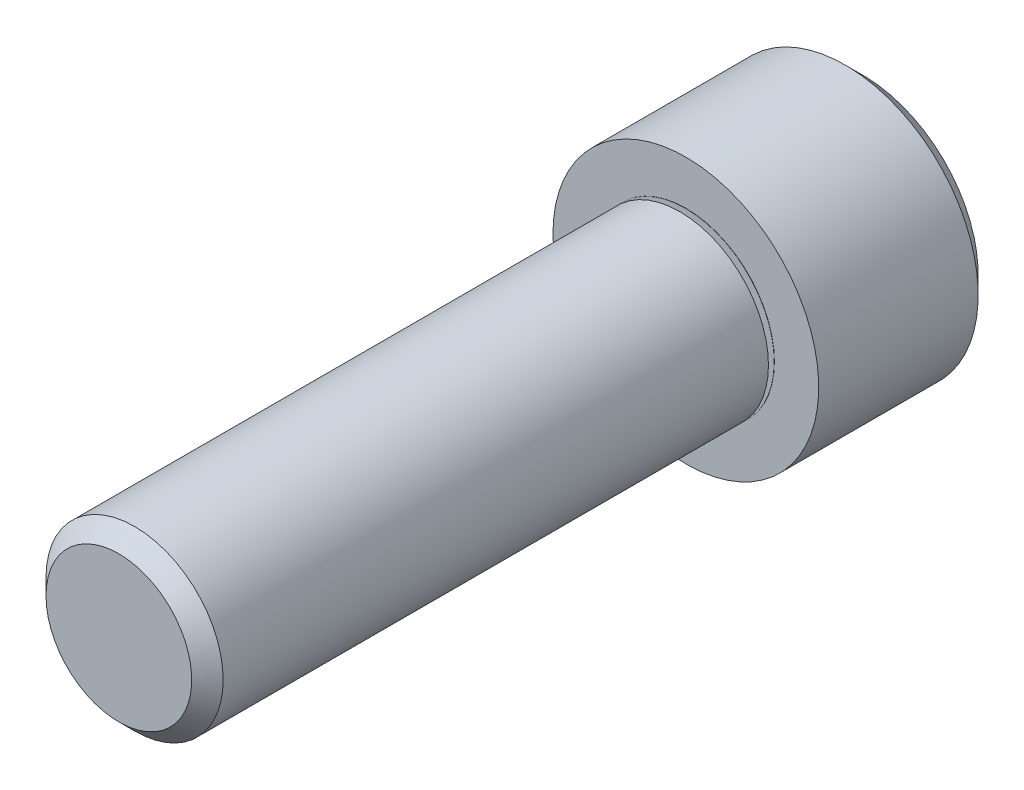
ISO-10303-21;
HEADER;
FILE_DESCRIPTION(('STEP AP214'),'2;1');
FILE_NAME('part.step','',(''),(''),'','','');
FILE_SCHEMA(('AUTOMOTIVE_DESIGN { 1 0 10303 214 1 1 1 1 }'));
ENDSEC;
DATA;
#1=APPLICATION_CONTEXT('core data for automotive mechanical design processes');
#2=APPLICATION_PROTOCOL_DEFINITION('international standard','automotive_design',2000,#1);
#3=PRODUCT_CONTEXT('',#1,'mechanical');
#4=PRODUCT('Part','Part','',(#3));
#5=PRODUCT_RELATED_PRODUCT_CATEGORY('part','',(#4));
#6=PRODUCT_DEFINITION_FORMATION('','',#4);
#7=PRODUCT_DEFINITION_CONTEXT('part definition',#1,'design');
#8=PRODUCT_DEFINITION('design','',#6,#7);
#9=PRODUCT_DEFINITION_SHAPE('','',#8);
#10=(LENGTH_UNIT() NAMED_UNIT(*) SI_UNIT(.MILLI.,.METRE.));
#11=(NAMED_UNIT(*) PLANE_ANGLE_UNIT() SI_UNIT($,.RADIAN.));
#12=(NAMED_UNIT(*) SI_UNIT($,.STERADIAN.) SOLID_ANGLE_UNIT());
#13=UNCERTAINTY_MEASURE_WITH_UNIT(LENGTH_MEASURE(1.E-05),#10,'distance_accuracy_value','');
#14=(GEOMETRIC_REPRESENTATION_CONTEXT(3) GLOBAL_UNCERTAINTY_ASSIGNED_CONTEXT((#13)) GLOBAL_UNIT_ASSIGNED_CONTEXT((#10,
#11,#12)) REPRESENTATION_CONTEXT('',''));
#15=CARTESIAN_POINT('',(0.,0.,0.));
#16=DIRECTION('',(0.,0.,1.));
#17=DIRECTION('',(1.,0.,0.));
#18=AXIS2_PLACEMENT_3D('',#15,#16,#17);
#19=CARTESIAN_POINT('',(0.,0.,-7.93749999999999));
#20=DIRECTION('',(0.,0.,1.));
#21=DIRECTION('',(1.,0.,0.));
#22=AXIS2_PLACEMENT_3D('',#19,#20,#21);
#23=PLANE('',#22);
#24=DIRECTION('',(-0.5,-0.866025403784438,0.));
#25=VECTOR('',#24,1.);
#26=CARTESIAN_POINT('',(3.66617420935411,0.,-7.93749999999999));
#27=LINE('',#26,#25);
#28=CARTESIAN_POINT('',(3.66617420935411,0.,-7.93749999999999));
#29=VERTEX_POINT('',#28);
#30=CARTESIAN_POINT('',(1.83308710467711,-3.17500000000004,-7.93749999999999));
#31=VERTEX_POINT('',#30);
#32=EDGE_CURVE('E164',#29,#31,#27,.T.);
#33=ORIENTED_EDGE('',*,*,#32,.F.);
#34=DIRECTION('',(0.499999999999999,-0.866025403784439,0.));
#35=VECTOR('',#34,1.);
#36=CARTESIAN_POINT('',(1.83308710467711,3.17499999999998,-7.93749999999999));
#37=LINE('',#36,#35);
#38=CARTESIAN_POINT('',(1.83308710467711,3.17499999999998,-7.93749999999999));
#39=VERTEX_POINT('',#38);
#40=EDGE_CURVE('E73',#39,#29,#37,.T.);
#41=ORIENTED_EDGE('',*,*,#40,.F.);
#42=DIRECTION('',(1.,0.,0.));
#43=VECTOR('',#42,1.);
#44=CARTESIAN_POINT('',(-1.83308710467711,3.17499999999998,-7.93749999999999));
#45=LINE('',#44,#43);
#46=CARTESIAN_POINT('',(-1.83308710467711,3.17499999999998,-7.93749999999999));
#47=VERTEX_POINT('',#46);
#48=EDGE_CURVE('E177',#47,#39,#45,.T.);
#49=ORIENTED_EDGE('',*,*,#48,.F.);
#50=DIRECTION('',(0.5,0.866025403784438,0.));
#51=VECTOR('',#50,1.);
#52=CARTESIAN_POINT('',(-3.66617420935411,0.,-7.93749999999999));
#53=LINE('',#52,#51);
#54=CARTESIAN_POINT('',(-3.66617420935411,0.,-7.93749999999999));
#55=VERTEX_POINT('',#54);
#56=EDGE_CURVE('E174',#55,#47,#53,.T.);
#57=ORIENTED_EDGE('',*,*,#56,.F.);
#58=DIRECTION('',(-0.5,0.866025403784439,0.));
#59=VECTOR('',#58,1.);
#60=CARTESIAN_POINT('',(-1.83308710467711,-3.17500000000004,-7.93749999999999));
#61=LINE('',#60,#59);
#62=CARTESIAN_POINT('',(-1.83308710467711,-3.17500000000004,-7.93749999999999));
#63=VERTEX_POINT('',#62);
#64=EDGE_CURVE('E130',#63,#55,#61,.T.);
#65=ORIENTED_EDGE('',*,*,#64,.F.);
#66=DIRECTION('',(-1.,0.,0.));
#67=VECTOR('',#66,1.);
#68=CARTESIAN_POINT('',(1.83308710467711,-3.17500000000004,-7.93749999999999));
#69=LINE('',#68,#67);
#70=EDGE_CURVE('E168',#31,#63,#69,.T.);
#71=ORIENTED_EDGE('',*,*,#70,.F.);
#72=EDGE_LOOP('',(#33,#41,#49,#57,#65,#71));
#73=FACE_BOUND('',#72,.T.);
#74=CARTESIAN_POINT('',(0.,0.,-7.93749999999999));
#75=DIRECTION('',(0.,0.,-1.));
#76=DIRECTION('',(-1.,0.,0.));
#77=AXIS2_PLACEMENT_3D('',#74,#75,#76);
#78=CIRCLE('',#77,5.15937500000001);
#79=CARTESIAN_POINT('',(-5.15937500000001,0.,-7.93749999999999));
#80=VERTEX_POINT('',#79);
#81=EDGE_CURVE('E183',#80,#80,#78,.T.);
#82=ORIENTED_EDGE('',*,*,#81,.T.);
#83=EDGE_LOOP('',(#82));
#84=FACE_BOUND('',#83,.T.);
#85=ADVANCED_FACE('F55',(#73,#84),#23,.F.);
#86=CARTESIAN_POINT('',(-3.26389999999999,0.,25.4));
#87=DIRECTION('',(0.,0.,-1.));
#88=DIRECTION('',(-1.,0.,0.));
#89=AXIS2_PLACEMENT_3D('',#86,#87,#88);
#90=PLANE('',#89);
#91=CARTESIAN_POINT('',(0.,0.,25.4));
#92=DIRECTION('',(0.,0.,-1.));
#93=DIRECTION('',(-1.,0.,0.));
#94=AXIS2_PLACEMENT_3D('',#91,#92,#93);
#95=CIRCLE('',#94,3.26390000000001);
#96=CARTESIAN_POINT('',(-3.26390000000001,0.,25.4));
#97=VERTEX_POINT('',#96);
#98=EDGE_CURVE('E11',#97,#97,#95,.T.);
#99=ORIENTED_EDGE('',*,*,#98,.F.);
#100=EDGE_LOOP('',(#99));
#101=FACE_BOUND('',#100,.T.);
#102=ADVANCED_FACE('F234',(#101),#90,.F.);
#103=CARTESIAN_POINT('',(0.,0.,25.4));
#104=DIRECTION('',(0.,0.,-1.));
#105=DIRECTION('',(-1.,0.,0.));
#106=AXIS2_PLACEMENT_3D('',#103,#104,#105);
#107=CONICAL_SURFACE('',#106,3.26390000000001,0.785398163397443);
#108=CARTESIAN_POINT('',(0.,0.,24.69515));
#109=DIRECTION('',(0.,0.,-1.));
#110=DIRECTION('',(-1.,0.,0.));
#111=AXIS2_PLACEMENT_3D('',#108,#109,#110);
#112=CIRCLE('',#111,3.96875000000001);
#113=CARTESIAN_POINT('',(-3.96875000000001,0.,24.69515));
#114=VERTEX_POINT('',#113);
#115=EDGE_CURVE('E63',#114,#114,#112,.T.);
#116=ORIENTED_EDGE('',*,*,#115,.F.);
#117=EDGE_LOOP('',(#116));
#118=FACE_BOUND('',#117,.T.);
#119=ORIENTED_EDGE('',*,*,#98,.T.);
#120=EDGE_LOOP('',(#119));
#121=FACE_BOUND('',#120,.T.);
#122=ADVANCED_FACE('F231',(#118,#121),#107,.T.);
#123=CARTESIAN_POINT('',(0.,0.,-10.585154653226));
#124=DIRECTION('',(0.,0.,-1.));
#125=DIRECTION('',(-1.,0.,0.));
#126=AXIS2_PLACEMENT_3D('',#123,#124,#125);
#127=CYLINDRICAL_SURFACE('',#126,3.96875000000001);
#128=CARTESIAN_POINT('',(0.,0.,0.266544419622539));
#129=DIRECTION('',(0.,0.,-1.));
#130=DIRECTION('',(-1.,0.,0.));
#131=AXIS2_PLACEMENT_3D('',#128,#129,#130);
#132=CIRCLE('',#131,3.96875000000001);
#133=CARTESIAN_POINT('',(-3.96875000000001,0.,0.266544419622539));
#134=VERTEX_POINT('',#133);
#135=EDGE_CURVE('E220',#134,#134,#132,.T.);
#136=ORIENTED_EDGE('',*,*,#135,.F.);
#137=EDGE_LOOP('',(#136));
#138=FACE_BOUND('',#137,.T.);
#139=ORIENTED_EDGE('',*,*,#115,.T.);
#140=EDGE_LOOP('',(#139));
#141=FACE_BOUND('',#140,.T.);
#142=ADVANCED_FACE('F229',(#138,#141),#127,.T.);
#143=CARTESIAN_POINT('',(0.,0.,0.266544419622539));
#144=DIRECTION('',(0.,0.,1.));
#145=DIRECTION('',(1.,0.,0.));
#146=AXIS2_PLACEMENT_3D('',#143,#144,#145);
#147=CONICAL_SURFACE('',#146,3.96875000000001,1.22173047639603);
#148=CARTESIAN_POINT('',(0.,0.,0.0487938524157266));
#149=DIRECTION('',(0.,0.,-1.));
#150=DIRECTION('',(-1.,0.,0.));
#151=AXIS2_PLACEMENT_3D('',#148,#149,#150);
#152=CIRCLE('',#151,3.37048523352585);
#153=CARTESIAN_POINT('',(-3.37048523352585,0.,0.0487938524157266));
#154=VERTEX_POINT('',#153);
#155=EDGE_CURVE('E216',#154,#154,#152,.T.);
#156=ORIENTED_EDGE('',*,*,#155,.F.);
#157=EDGE_LOOP('',(#156));
#158=FACE_BOUND('',#157,.T.);
#159=ORIENTED_EDGE('',*,*,#135,.T.);
#160=EDGE_LOOP('',(#159));
#161=FACE_BOUND('',#160,.T.);
#162=ADVANCED_FACE('F248',(#158,#161),#147,.T.);
#163=CARTESIAN_POINT('',(0.,0.,0.0300000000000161));
#164=DIRECTION('',(0.,0.,-1.));
#165=DIRECTION('',(-1.,0.,0.));
#166=AXIS2_PLACEMENT_3D('',#163,#164,#165);
#167=TOROIDAL_SURFACE('',#166,3.37732563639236,0.0199999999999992);
#168=CARTESIAN_POINT('',(0.,0.,0.0100000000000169));
#169=DIRECTION('',(0.,0.,-1.));
#170=DIRECTION('',(-1.,0.,0.));
#171=AXIS2_PLACEMENT_3D('',#168,#169,#170);
#172=CIRCLE('',#171,3.37732563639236);
#173=CARTESIAN_POINT('',(-3.37732563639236,0.,0.0100000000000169));
#174=VERTEX_POINT('',#173);
#175=EDGE_CURVE('E212',#174,#174,#172,.T.);
#176=ORIENTED_EDGE('',*,*,#175,.F.);
#177=EDGE_LOOP('',(#176));
#178=FACE_BOUND('',#177,.T.);
#179=ORIENTED_EDGE('',*,*,#155,.T.);
#180=EDGE_LOOP('',(#179));
#181=FACE_BOUND('',#180,.T.);
#182=ADVANCED_FACE('F252',(#178,#181),#167,.F.);
#183=CARTESIAN_POINT('',(-3.96874999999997,0.,0.01000000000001));
#184=DIRECTION('',(0.,0.,-1.));
#185=DIRECTION('',(-1.,0.,0.));
#186=AXIS2_PLACEMENT_3D('',#183,#184,#185);
#187=PLANE('',#186);
#188=CARTESIAN_POINT('',(0.,0.,0.01000000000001));
#189=DIRECTION('',(0.,0.,-1.));
#190=DIRECTION('',(-1.,0.,0.));
#191=AXIS2_PLACEMENT_3D('',#188,#189,#190);
#192=CIRCLE('',#191,3.96875);
#193=CARTESIAN_POINT('',(-3.96875,0.,0.01000000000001));
#194=VERTEX_POINT('',#193);
#195=EDGE_CURVE('E208',#194,#194,#192,.T.);
#196=ORIENTED_EDGE('',*,*,#195,.F.);
#197=EDGE_LOOP('',(#196));
#198=FACE_BOUND('',#197,.T.);
#199=ORIENTED_EDGE('',*,*,#175,.T.);
#200=EDGE_LOOP('',(#199));
#201=FACE_BOUND('',#200,.T.);
#202=ADVANCED_FACE('F256',(#198,#201),#187,.F.);
#203=CARTESIAN_POINT('',(0.,0.,-10.585154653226));
#204=DIRECTION('',(0.,0.,-1.));
#205=DIRECTION('',(-1.,0.,0.));
#206=AXIS2_PLACEMENT_3D('',#203,#204,#205);
#207=CYLINDRICAL_SURFACE('',#206,3.96875);
#208=CARTESIAN_POINT('',(0.,0.,0.));
#209=DIRECTION('',(0.,0.,-1.));
#210=DIRECTION('',(-1.,0.,0.));
#211=AXIS2_PLACEMENT_3D('',#208,#209,#210);
#212=CIRCLE('',#211,3.96875);
#213=CARTESIAN_POINT('',(-3.96875,0.,0.));
#214=VERTEX_POINT('',#213);
#215=EDGE_CURVE('E204',#214,#214,#212,.T.);
#216=ORIENTED_EDGE('',*,*,#215,.F.);
#217=EDGE_LOOP('',(#216));
#218=FACE_BOUND('',#217,.T.);
#219=ORIENTED_EDGE('',*,*,#195,.T.);
#220=EDGE_LOOP('',(#219));
#221=FACE_BOUND('',#220,.T.);
#222=ADVANCED_FACE('F260',(#218,#221),#207,.T.);
#223=CARTESIAN_POINT('',(-5.953125,0.,0.));
#224=DIRECTION('',(0.,0.,-1.));
#225=DIRECTION('',(-1.,0.,0.));
#226=AXIS2_PLACEMENT_3D('',#223,#224,#225);
#227=PLANE('',#226);
#228=CARTESIAN_POINT('',(0.,0.,0.));
#229=DIRECTION('',(0.,0.,-1.));
#230=DIRECTION('',(-1.,0.,0.));
#231=AXIS2_PLACEMENT_3D('',#228,#229,#230);
#232=CIRCLE('',#231,5.95312500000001);
#233=CARTESIAN_POINT('',(-5.95312500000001,0.,0.));
#234=VERTEX_POINT('',#233);
#235=EDGE_CURVE('E200',#234,#234,#232,.T.);
#236=ORIENTED_EDGE('',*,*,#235,.F.);
#237=EDGE_LOOP('',(#236));
#238=FACE_BOUND('',#237,.T.);
#239=ORIENTED_EDGE('',*,*,#215,.T.);
#240=EDGE_LOOP('',(#239));
#241=FACE_BOUND('',#240,.T.);
#242=ADVANCED_FACE('F264',(#238,#241),#227,.F.);
#243=CARTESIAN_POINT('',(0.,0.,-10.585154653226));
#244=DIRECTION('',(0.,0.,-1.));
#245=DIRECTION('',(-1.,0.,0.));
#246=AXIS2_PLACEMENT_3D('',#243,#244,#245);
#247=CYLINDRICAL_SURFACE('',#246,5.953125);
#248=CARTESIAN_POINT('',(0.,0.,-7.14375));
#249=DIRECTION('',(0.,0.,-1.));
#250=DIRECTION('',(-1.,0.,0.));
#251=AXIS2_PLACEMENT_3D('',#248,#249,#250);
#252=CIRCLE('',#251,5.953125);
#253=CARTESIAN_POINT('',(-5.953125,0.,-7.14375));
#254=VERTEX_POINT('',#253);
#255=EDGE_CURVE('E196',#254,#254,#252,.T.);
#256=ORIENTED_EDGE('',*,*,#255,.F.);
#257=EDGE_LOOP('',(#256));
#258=FACE_BOUND('',#257,.T.);
#259=ORIENTED_EDGE('',*,*,#235,.T.);
#260=EDGE_LOOP('',(#259));
#261=FACE_BOUND('',#260,.T.);
#262=ADVANCED_FACE('F268',(#258,#261),#247,.T.);
#263=CARTESIAN_POINT('',(0.,0.,-7.14375));
#264=DIRECTION('',(0.,0.,1.));
#265=DIRECTION('',(1.,0.,0.));
#266=AXIS2_PLACEMENT_3D('',#263,#264,#265);
#267=CONICAL_SURFACE('',#266,5.953125,0.785398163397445);
#268=ORIENTED_EDGE('',*,*,#81,.F.);
#269=EDGE_LOOP('',(#268));
#270=FACE_BOUND('',#269,.T.);
#271=ORIENTED_EDGE('',*,*,#255,.T.);
#272=EDGE_LOOP('',(#271));
#273=FACE_BOUND('',#272,.T.);
#274=ADVANCED_FACE('F272',(#270,#273),#267,.T.);
#275=CARTESIAN_POINT('',(1.83308710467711,3.17499999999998,-3.96875));
#276=DIRECTION('',(0.866025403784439,0.5,0.));
#277=DIRECTION('',(-0.5,0.866025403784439,0.));
#278=AXIS2_PLACEMENT_3D('',#275,#276,#277);
#279=PLANE('',#278);
#280=ORIENTED_EDGE('',*,*,#40,.T.);
#281=DIRECTION('',(0.,0.,-1.));
#282=VECTOR('',#281,1.);
#283=CARTESIAN_POINT('',(3.66617420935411,0.,-3.96875));
#284=LINE('',#283,#282);
#285=CARTESIAN_POINT('',(3.66617420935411,0.,-3.96875));
#286=VERTEX_POINT('',#285);
#287=EDGE_CURVE('E111',#286,#29,#284,.T.);
#288=ORIENTED_EDGE('',*,*,#287,.F.);
#289=DIRECTION('',(0.499999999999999,-0.866025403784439,0.));
#290=VECTOR('',#289,1.);
#291=CARTESIAN_POINT('',(1.83308710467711,3.17499999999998,-3.96875));
#292=LINE('',#291,#290);
#293=CARTESIAN_POINT('',(1.83308710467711,3.17499999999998,-3.96875));
#294=VERTEX_POINT('',#293);
#295=EDGE_CURVE('E180',#294,#286,#292,.T.);
#296=ORIENTED_EDGE('',*,*,#295,.F.);
#297=DIRECTION('',(0.,0.,-1.));
#298=VECTOR('',#297,1.);
#299=CARTESIAN_POINT('',(1.83308710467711,3.17499999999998,-3.96875));
#300=LINE('',#299,#298);
#301=EDGE_CURVE('E84',#294,#39,#300,.T.);
#302=ORIENTED_EDGE('',*,*,#301,.T.);
#303=EDGE_LOOP('',(#280,#288,#296,#302));
#304=FACE_BOUND('',#303,.T.);
#305=ADVANCED_FACE('F276',(#304),#279,.F.);
#306=CARTESIAN_POINT('',(-1.83308710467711,3.17499999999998,-3.96875));
#307=DIRECTION('',(0.,1.,0.));
#308=DIRECTION('',(-1.,0.,0.));
#309=AXIS2_PLACEMENT_3D('',#306,#307,#308);
#310=PLANE('',#309);
#311=ORIENTED_EDGE('',*,*,#48,.T.);
#312=ORIENTED_EDGE('',*,*,#301,.F.);
#313=DIRECTION('',(1.,0.,0.));
#314=VECTOR('',#313,1.);
#315=CARTESIAN_POINT('',(-1.83308710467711,3.17499999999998,-3.96875));
#316=LINE('',#315,#314);
#317=CARTESIAN_POINT('',(-1.83308710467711,3.17499999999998,-3.96875));
#318=VERTEX_POINT('',#317);
#319=EDGE_CURVE('E144',#318,#294,#316,.T.);
#320=ORIENTED_EDGE('',*,*,#319,.F.);
#321=DIRECTION('',(0.,0.,-1.));
#322=VECTOR('',#321,1.);
#323=CARTESIAN_POINT('',(-1.83308710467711,3.17499999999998,-3.96875));
#324=LINE('',#323,#322);
#325=EDGE_CURVE('E135',#318,#47,#324,.T.);
#326=ORIENTED_EDGE('',*,*,#325,.T.);
#327=EDGE_LOOP('',(#311,#312,#320,#326));
#328=FACE_BOUND('',#327,.T.);
#329=ADVANCED_FACE('F280',(#328),#310,.F.);
#330=CARTESIAN_POINT('',(-3.66617420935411,0.,-3.96875));
#331=DIRECTION('',(-0.866025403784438,0.5,0.));
#332=DIRECTION('',(-0.5,-0.866025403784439,0.));
#333=AXIS2_PLACEMENT_3D('',#330,#331,#332);
#334=PLANE('',#333);
#335=ORIENTED_EDGE('',*,*,#56,.T.);
#336=ORIENTED_EDGE('',*,*,#325,.F.);
#337=DIRECTION('',(0.5,0.866025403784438,0.));
#338=VECTOR('',#337,1.);
#339=CARTESIAN_POINT('',(-3.66617420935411,0.,-3.96875));
#340=LINE('',#339,#338);
#341=CARTESIAN_POINT('',(-3.66617420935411,0.,-3.96875));
#342=VERTEX_POINT('',#341);
#343=EDGE_CURVE('E139',#342,#318,#340,.T.);
#344=ORIENTED_EDGE('',*,*,#343,.F.);
#345=DIRECTION('',(0.,0.,-1.));
#346=VECTOR('',#345,1.);
#347=CARTESIAN_POINT('',(-3.66617420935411,0.,-3.96875));
#348=LINE('',#347,#346);
#349=EDGE_CURVE('E123',#342,#55,#348,.T.);
#350=ORIENTED_EDGE('',*,*,#349,.T.);
#351=EDGE_LOOP('',(#335,#336,#344,#350));
#352=FACE_BOUND('',#351,.T.);
#353=ADVANCED_FACE('F140',(#352),#334,.F.);
#354=CARTESIAN_POINT('',(-1.83308710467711,-3.17500000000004,-3.96875));
#355=DIRECTION('',(-0.866025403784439,-0.5,0.));
#356=DIRECTION('',(0.5,-0.866025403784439,0.));
#357=AXIS2_PLACEMENT_3D('',#354,#355,#356);
#358=PLANE('',#357);
#359=ORIENTED_EDGE('',*,*,#64,.T.);
#360=ORIENTED_EDGE('',*,*,#349,.F.);
#361=DIRECTION('',(-0.5,0.866025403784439,0.));
#362=VECTOR('',#361,1.);
#363=CARTESIAN_POINT('',(-1.83308710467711,-3.17500000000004,-3.96875));
#364=LINE('',#363,#362);
#365=CARTESIAN_POINT('',(-1.83308710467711,-3.17500000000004,-3.96875));
#366=VERTEX_POINT('',#365);
#367=EDGE_CURVE('E127',#366,#342,#364,.T.);
#368=ORIENTED_EDGE('',*,*,#367,.F.);
#369=DIRECTION('',(0.,0.,-1.));
#370=VECTOR('',#369,1.);
#371=CARTESIAN_POINT('',(-1.83308710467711,-3.17500000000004,-3.96875));
#372=LINE('',#371,#370);
#373=EDGE_CURVE('E136',#366,#63,#372,.T.);
#374=ORIENTED_EDGE('',*,*,#373,.T.);
#375=EDGE_LOOP('',(#359,#360,#368,#374));
#376=FACE_BOUND('',#375,.T.);
#377=ADVANCED_FACE('F125',(#376),#358,.F.);
#378=CARTESIAN_POINT('',(1.83308710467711,-3.17500000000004,-3.96875));
#379=DIRECTION('',(0.,-1.,0.));
#380=DIRECTION('',(0.,0.,-1.));
#381=AXIS2_PLACEMENT_3D('',#378,#379,#380);
#382=PLANE('',#381);
#383=ORIENTED_EDGE('',*,*,#70,.T.);
#384=ORIENTED_EDGE('',*,*,#373,.F.);
#385=DIRECTION('',(-1.,0.,0.));
#386=VECTOR('',#385,1.);
#387=CARTESIAN_POINT('',(1.83308710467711,-3.17500000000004,-3.96875));
#388=LINE('',#387,#386);
#389=CARTESIAN_POINT('',(1.83308710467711,-3.17500000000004,-3.96875));
#390=VERTEX_POINT('',#389);
#391=EDGE_CURVE('E150',#390,#366,#388,.T.);
#392=ORIENTED_EDGE('',*,*,#391,.F.);
#393=DIRECTION('',(0.,0.,-1.));
#394=VECTOR('',#393,1.);
#395=CARTESIAN_POINT('',(1.83308710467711,-3.17500000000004,-3.96875));
#396=LINE('',#395,#394);
#397=EDGE_CURVE('E188',#390,#31,#396,.T.);
#398=ORIENTED_EDGE('',*,*,#397,.T.);
#399=EDGE_LOOP('',(#383,#384,#392,#398));
#400=FACE_BOUND('',#399,.T.);
#401=ADVANCED_FACE('F284',(#400),#382,.F.);
#402=CARTESIAN_POINT('',(3.66617420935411,0.,-3.96875));
#403=DIRECTION('',(0.866025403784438,-0.5,0.));
#404=DIRECTION('',(0.5,0.866025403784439,0.));
#405=AXIS2_PLACEMENT_3D('',#402,#403,#404);
#406=PLANE('',#405);
#407=ORIENTED_EDGE('',*,*,#32,.T.);
#408=ORIENTED_EDGE('',*,*,#397,.F.);
#409=DIRECTION('',(-0.5,-0.866025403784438,0.));
#410=VECTOR('',#409,1.);
#411=CARTESIAN_POINT('',(3.66617420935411,0.,-3.96875));
#412=LINE('',#411,#410);
#413=EDGE_CURVE('E156',#286,#390,#412,.T.);
#414=ORIENTED_EDGE('',*,*,#413,.F.);
#415=ORIENTED_EDGE('',*,*,#287,.T.);
#416=EDGE_LOOP('',(#407,#408,#414,#415));
#417=FACE_BOUND('',#416,.T.);
#418=ADVANCED_FACE('F281',(#417),#406,.F.);
#419=CARTESIAN_POINT('',(1.83308710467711,3.17499999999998,-3.96875));
#420=DIRECTION('',(0.,0.,1.));
#421=DIRECTION('',(1.,0.,0.));
#422=AXIS2_PLACEMENT_3D('',#419,#420,#421);
#423=PLANE('',#422);
#424=ORIENTED_EDGE('',*,*,#295,.T.);
#425=ORIENTED_EDGE('',*,*,#413,.T.);
#426=ORIENTED_EDGE('',*,*,#391,.T.);
#427=ORIENTED_EDGE('',*,*,#367,.T.);
#428=ORIENTED_EDGE('',*,*,#343,.T.);
#429=ORIENTED_EDGE('',*,*,#319,.T.);
#430=EDGE_LOOP('',(#424,#425,#426,#427,#428,#429));
#431=FACE_BOUND('',#430,.T.);
#432=ADVANCED_FACE('F147',(#431),#423,.F.);
#433=CLOSED_SHELL('',(#85,#102,#122,#142,#162,#182,#202,#222,#242,#262,#274,#305,#329,#353,#377,
#401,#418,#432));
#434=MANIFOLD_SOLID_BREP('B2',#433);
#435=ADVANCED_BREP_SHAPE_REPRESENTATION('',(#18,#434),#14);
#436=SHAPE_DEFINITION_REPRESENTATION(#9,#435);
ENDSEC;
END-ISO-10303-21;
